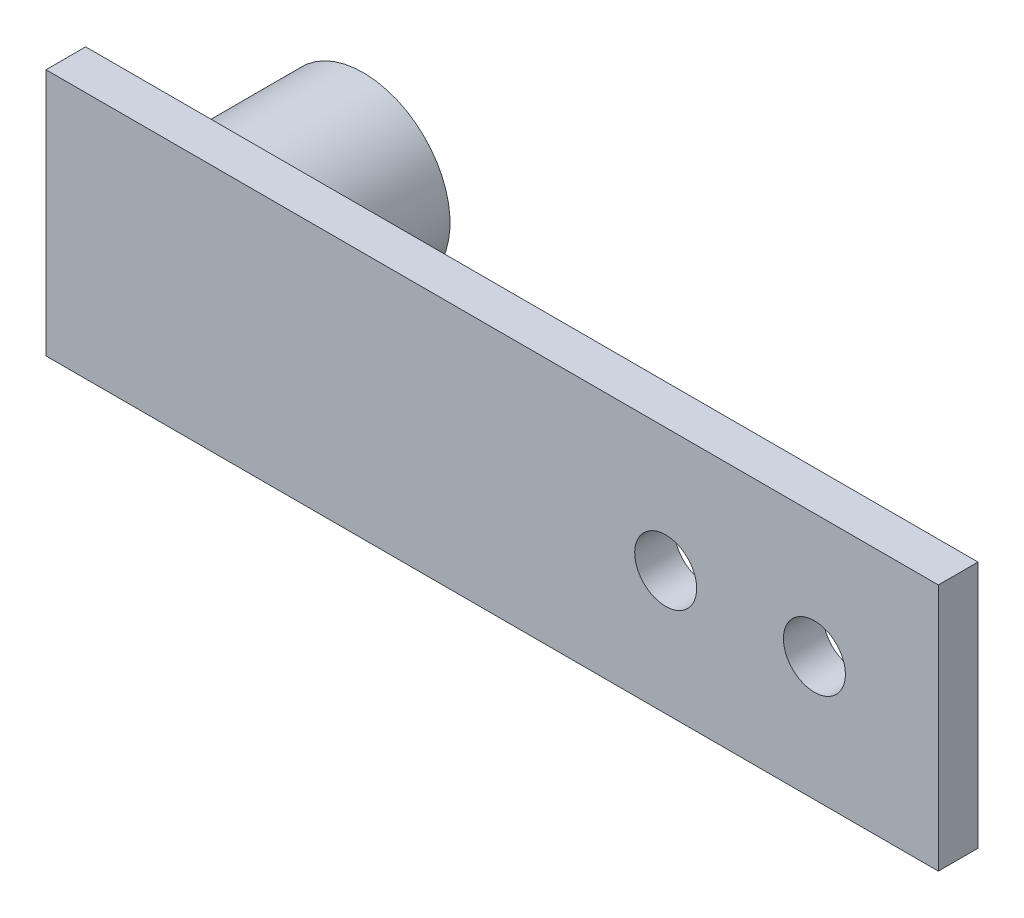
ISO-10303-21;
HEADER;
FILE_DESCRIPTION(('STEP AP214'),'2;1');
FILE_NAME('part.step','',(''),(''),'','','');
FILE_SCHEMA(('AUTOMOTIVE_DESIGN { 1 0 10303 214 1 1 1 1 }'));
ENDSEC;
DATA;
#1=APPLICATION_CONTEXT('core data for automotive mechanical design processes');
#2=APPLICATION_PROTOCOL_DEFINITION('international standard','automotive_design',2000,#1);
#3=PRODUCT_CONTEXT('',#1,'mechanical');
#4=PRODUCT('Part','Part','',(#3));
#5=PRODUCT_RELATED_PRODUCT_CATEGORY('part','',(#4));
#6=PRODUCT_DEFINITION_FORMATION('','',#4);
#7=PRODUCT_DEFINITION_CONTEXT('part definition',#1,'design');
#8=PRODUCT_DEFINITION('design','',#6,#7);
#9=PRODUCT_DEFINITION_SHAPE('','',#8);
#10=(LENGTH_UNIT() NAMED_UNIT(*) SI_UNIT(.MILLI.,.METRE.));
#11=(NAMED_UNIT(*) PLANE_ANGLE_UNIT() SI_UNIT($,.RADIAN.));
#12=(NAMED_UNIT(*) SI_UNIT($,.STERADIAN.) SOLID_ANGLE_UNIT());
#13=UNCERTAINTY_MEASURE_WITH_UNIT(LENGTH_MEASURE(1.E-05),#10,'distance_accuracy_value','');
#14=(GEOMETRIC_REPRESENTATION_CONTEXT(3) GLOBAL_UNCERTAINTY_ASSIGNED_CONTEXT((#13)) GLOBAL_UNIT_ASSIGNED_CONTEXT((#10,
#11,#12)) REPRESENTATION_CONTEXT('',''));
#15=CARTESIAN_POINT('',(0.,0.,0.));
#16=DIRECTION('',(0.,0.,1.));
#17=DIRECTION('',(1.,0.,0.));
#18=AXIS2_PLACEMENT_3D('',#15,#16,#17);
#19=CARTESIAN_POINT('',(-25.,25.,30.));
#20=DIRECTION('',(0.,0.,1.));
#21=DIRECTION('',(0.,-1.,0.));
#22=AXIS2_PLACEMENT_3D('',#19,#20,#21);
#23=PLANE('',#22);
#24=CARTESIAN_POINT('',(0.,0.,30.));
#25=DIRECTION('',(0.,0.,-1.));
#26=DIRECTION('',(-1.,0.,0.));
#27=AXIS2_PLACEMENT_3D('',#24,#25,#26);
#28=CIRCLE('',#27,17.5);
#29=CARTESIAN_POINT('',(-17.5,0.,30.));
#30=VERTEX_POINT('',#29);
#31=CARTESIAN_POINT('',(0.,17.5,30.));
#32=VERTEX_POINT('',#31);
#33=EDGE_CURVE('E25',#30,#32,#28,.T.);
#34=ORIENTED_EDGE('',*,*,#33,.F.);
#35=DIRECTION('',(0.,-1.,0.));
#36=VECTOR('',#35,1.);
#37=CARTESIAN_POINT('',(-17.5,17.5,30.));
#38=LINE('',#37,#36);
#39=CARTESIAN_POINT('',(-17.5,17.5,30.));
#40=VERTEX_POINT('',#39);
#41=EDGE_CURVE('E96',#40,#30,#38,.T.);
#42=ORIENTED_EDGE('',*,*,#41,.F.);
#43=DIRECTION('',(-1.,0.,0.));
#44=VECTOR('',#43,1.);
#45=CARTESIAN_POINT('',(17.5,17.5,30.));
#46=LINE('',#45,#44);
#47=EDGE_CURVE('E111',#32,#40,#46,.T.);
#48=ORIENTED_EDGE('',*,*,#47,.F.);
#49=EDGE_LOOP('',(#34,#42,#48));
#50=FACE_BOUND('',#49,.T.);
#51=ADVANCED_FACE('F14',(#50),#23,.F.);
#52=CARTESIAN_POINT('',(17.5,0.,30.));
#53=VERTEX_POINT('',#52);
#54=EDGE_CURVE('E9',#32,#53,#28,.T.);
#55=ORIENTED_EDGE('',*,*,#54,.F.);
#56=CARTESIAN_POINT('',(17.5,17.5,30.));
#57=VERTEX_POINT('',#56);
#58=EDGE_CURVE('E109',#57,#32,#46,.T.);
#59=ORIENTED_EDGE('',*,*,#58,.F.);
#60=DIRECTION('',(0.,1.,0.));
#61=VECTOR('',#60,1.);
#62=CARTESIAN_POINT('',(17.5,17.5,30.));
#63=LINE('',#62,#61);
#64=EDGE_CURVE('E175',#53,#57,#63,.T.);
#65=ORIENTED_EDGE('',*,*,#64,.F.);
#66=EDGE_LOOP('',(#55,#59,#65));
#67=FACE_BOUND('',#66,.T.);
#68=ADVANCED_FACE('F193',(#67),#23,.F.);
#69=CARTESIAN_POINT('',(0.,-17.5,30.));
#70=VERTEX_POINT('',#69);
#71=EDGE_CURVE('E23',#53,#70,#28,.T.);
#72=ORIENTED_EDGE('',*,*,#71,.F.);
#73=CARTESIAN_POINT('',(17.5,-17.5,30.));
#74=VERTEX_POINT('',#73);
#75=EDGE_CURVE('E163',#74,#53,#63,.T.);
#76=ORIENTED_EDGE('',*,*,#75,.F.);
#77=DIRECTION('',(1.,0.,0.));
#78=VECTOR('',#77,1.);
#79=CARTESIAN_POINT('',(17.5,-17.5,30.));
#80=LINE('',#79,#78);
#81=EDGE_CURVE('E103',#70,#74,#80,.T.);
#82=ORIENTED_EDGE('',*,*,#81,.F.);
#83=EDGE_LOOP('',(#72,#76,#82));
#84=FACE_BOUND('',#83,.T.);
#85=ADVANCED_FACE('F196',(#84),#23,.F.);
#86=EDGE_CURVE('E38',#70,#30,#28,.T.);
#87=ORIENTED_EDGE('',*,*,#86,.F.);
#88=CARTESIAN_POINT('',(-17.5,-17.5,30.));
#89=VERTEX_POINT('',#88);
#90=EDGE_CURVE('E107',#89,#70,#80,.T.);
#91=ORIENTED_EDGE('',*,*,#90,.F.);
#92=EDGE_CURVE('E98',#30,#89,#38,.T.);
#93=ORIENTED_EDGE('',*,*,#92,.F.);
#94=EDGE_LOOP('',(#87,#91,#93));
#95=FACE_BOUND('',#94,.T.);
#96=ADVANCED_FACE('F105',(#95),#23,.F.);
#97=CARTESIAN_POINT('',(17.5,17.5,31.));
#98=DIRECTION('',(0.,-1.,0.));
#99=DIRECTION('',(1.,0.,0.));
#100=AXIS2_PLACEMENT_3D('',#97,#98,#99);
#101=PLANE('',#100);
#102=ORIENTED_EDGE('',*,*,#58,.T.);
#103=ORIENTED_EDGE('',*,*,#47,.T.);
#104=DIRECTION('',(0.,0.,-1.));
#105=VECTOR('',#104,1.);
#106=CARTESIAN_POINT('',(-17.5,17.5,31.));
#107=LINE('',#106,#105);
#108=CARTESIAN_POINT('',(-17.5,17.5,31.));
#109=VERTEX_POINT('',#108);
#110=EDGE_CURVE('E100',#109,#40,#107,.T.);
#111=ORIENTED_EDGE('',*,*,#110,.F.);
#112=DIRECTION('',(-1.,0.,0.));
#113=VECTOR('',#112,1.);
#114=CARTESIAN_POINT('',(17.5,17.5,31.));
#115=LINE('',#114,#113);
#116=CARTESIAN_POINT('',(17.5,17.5,31.));
#117=VERTEX_POINT('',#116);
#118=EDGE_CURVE('E159',#117,#109,#115,.T.);
#119=ORIENTED_EDGE('',*,*,#118,.F.);
#120=DIRECTION('',(0.,0.,-1.));
#121=VECTOR('',#120,1.);
#122=CARTESIAN_POINT('',(17.5,17.5,31.));
#123=LINE('',#122,#121);
#124=EDGE_CURVE('E172',#117,#57,#123,.T.);
#125=ORIENTED_EDGE('',*,*,#124,.T.);
#126=EDGE_LOOP('',(#102,#103,#111,#119,#125));
#127=FACE_BOUND('',#126,.T.);
#128=ADVANCED_FACE('F16',(#127),#101,.F.);
#129=CARTESIAN_POINT('',(-17.5,17.5,31.));
#130=DIRECTION('',(1.,0.,0.));
#131=DIRECTION('',(0.,0.,1.));
#132=AXIS2_PLACEMENT_3D('',#129,#130,#131);
#133=PLANE('',#132);
#134=ORIENTED_EDGE('',*,*,#41,.T.);
#135=ORIENTED_EDGE('',*,*,#92,.T.);
#136=DIRECTION('',(0.,0.,-1.));
#137=VECTOR('',#136,1.);
#138=CARTESIAN_POINT('',(-17.5,-17.5,31.));
#139=LINE('',#138,#137);
#140=CARTESIAN_POINT('',(-17.5,-17.5,31.));
#141=VERTEX_POINT('',#140);
#142=EDGE_CURVE('E117',#141,#89,#139,.T.);
#143=ORIENTED_EDGE('',*,*,#142,.F.);
#144=DIRECTION('',(0.,-1.,0.));
#145=VECTOR('',#144,1.);
#146=CARTESIAN_POINT('',(-17.5,17.5,31.));
#147=LINE('',#146,#145);
#148=EDGE_CURVE('E162',#109,#141,#147,.T.);
#149=ORIENTED_EDGE('',*,*,#148,.F.);
#150=ORIENTED_EDGE('',*,*,#110,.T.);
#151=EDGE_LOOP('',(#134,#135,#143,#149,#150));
#152=FACE_BOUND('',#151,.T.);
#153=ADVANCED_FACE('F97',(#152),#133,.F.);
#154=CARTESIAN_POINT('',(17.5,-17.5,31.));
#155=DIRECTION('',(0.,1.,0.));
#156=DIRECTION('',(0.,0.,1.));
#157=AXIS2_PLACEMENT_3D('',#154,#155,#156);
#158=PLANE('',#157);
#159=ORIENTED_EDGE('',*,*,#90,.T.);
#160=ORIENTED_EDGE('',*,*,#81,.T.);
#161=DIRECTION('',(0.,0.,-1.));
#162=VECTOR('',#161,1.);
#163=CARTESIAN_POINT('',(17.5,-17.5,31.));
#164=LINE('',#163,#162);
#165=CARTESIAN_POINT('',(17.5,-17.5,31.));
#166=VERTEX_POINT('',#165);
#167=EDGE_CURVE('E180',#166,#74,#164,.T.);
#168=ORIENTED_EDGE('',*,*,#167,.F.);
#169=DIRECTION('',(1.,0.,0.));
#170=VECTOR('',#169,1.);
#171=CARTESIAN_POINT('',(17.5,-17.5,31.));
#172=LINE('',#171,#170);
#173=EDGE_CURVE('E166',#141,#166,#172,.T.);
#174=ORIENTED_EDGE('',*,*,#173,.F.);
#175=ORIENTED_EDGE('',*,*,#142,.T.);
#176=EDGE_LOOP('',(#159,#160,#168,#174,#175));
#177=FACE_BOUND('',#176,.T.);
#178=ADVANCED_FACE('F185',(#177),#158,.F.);
#179=CARTESIAN_POINT('',(17.5,17.5,31.));
#180=DIRECTION('',(-1.,0.,0.));
#181=DIRECTION('',(0.,0.,-1.));
#182=AXIS2_PLACEMENT_3D('',#179,#180,#181);
#183=PLANE('',#182);
#184=ORIENTED_EDGE('',*,*,#75,.T.);
#185=ORIENTED_EDGE('',*,*,#64,.T.);
#186=ORIENTED_EDGE('',*,*,#124,.F.);
#187=DIRECTION('',(0.,1.,0.));
#188=VECTOR('',#187,1.);
#189=CARTESIAN_POINT('',(17.5,17.5,31.));
#190=LINE('',#189,#188);
#191=EDGE_CURVE('E169',#166,#117,#190,.T.);
#192=ORIENTED_EDGE('',*,*,#191,.F.);
#193=ORIENTED_EDGE('',*,*,#167,.T.);
#194=EDGE_LOOP('',(#184,#185,#186,#192,#193));
#195=FACE_BOUND('',#194,.T.);
#196=ADVANCED_FACE('F192',(#195),#183,.F.);
#197=CARTESIAN_POINT('',(-25.,25.,31.));
#198=DIRECTION('',(0.,0.,1.));
#199=DIRECTION('',(0.,-1.,0.));
#200=AXIS2_PLACEMENT_3D('',#197,#198,#199);
#201=PLANE('',#200);
#202=CARTESIAN_POINT('',(100.,0.,31.));
#203=DIRECTION('',(0.,0.,1.));
#204=DIRECTION('',(0.,-1.,0.));
#205=AXIS2_PLACEMENT_3D('',#202,#203,#204);
#206=CIRCLE('',#205,6.25);
#207=CARTESIAN_POINT('',(100.,-6.25,31.));
#208=VERTEX_POINT('',#207);
#209=EDGE_CURVE('E123',#208,#208,#206,.T.);
#210=ORIENTED_EDGE('',*,*,#209,.T.);
#211=EDGE_LOOP('',(#210));
#212=FACE_BOUND('',#211,.T.);
#213=CARTESIAN_POINT('',(130.,0.,31.));
#214=DIRECTION('',(0.,0.,1.));
#215=DIRECTION('',(0.,-1.,0.));
#216=AXIS2_PLACEMENT_3D('',#213,#214,#215);
#217=CIRCLE('',#216,6.25);
#218=CARTESIAN_POINT('',(130.,-6.25,31.));
#219=VERTEX_POINT('',#218);
#220=EDGE_CURVE('E18',#219,#219,#217,.T.);
#221=ORIENTED_EDGE('',*,*,#220,.T.);
#222=EDGE_LOOP('',(#221));
#223=FACE_BOUND('',#222,.T.);
#224=DIRECTION('',(-1.,0.,0.));
#225=VECTOR('',#224,1.);
#226=CARTESIAN_POINT('',(155.,25.,31.));
#227=LINE('',#226,#225);
#228=CARTESIAN_POINT('',(155.,25.,31.));
#229=VERTEX_POINT('',#228);
#230=CARTESIAN_POINT('',(-25.,25.,31.));
#231=VERTEX_POINT('',#230);
#232=EDGE_CURVE('E140',#229,#231,#227,.T.);
#233=ORIENTED_EDGE('',*,*,#232,.F.);
#234=DIRECTION('',(0.,1.,0.));
#235=VECTOR('',#234,1.);
#236=CARTESIAN_POINT('',(155.,25.,31.));
#237=LINE('',#236,#235);
#238=CARTESIAN_POINT('',(155.,-25.,31.));
#239=VERTEX_POINT('',#238);
#240=EDGE_CURVE('E133',#239,#229,#237,.T.);
#241=ORIENTED_EDGE('',*,*,#240,.F.);
#242=DIRECTION('',(1.,0.,0.));
#243=VECTOR('',#242,1.);
#244=CARTESIAN_POINT('',(155.,-25.,31.));
#245=LINE('',#244,#243);
#246=CARTESIAN_POINT('',(-25.,-25.,31.));
#247=VERTEX_POINT('',#246);
#248=EDGE_CURVE('E145',#247,#239,#245,.T.);
#249=ORIENTED_EDGE('',*,*,#248,.F.);
#250=DIRECTION('',(0.,-1.,0.));
#251=VECTOR('',#250,1.);
#252=CARTESIAN_POINT('',(-25.,25.,31.));
#253=LINE('',#252,#251);
#254=EDGE_CURVE('E143',#231,#247,#253,.T.);
#255=ORIENTED_EDGE('',*,*,#254,.F.);
#256=EDGE_LOOP('',(#233,#241,#249,#255));
#257=FACE_BOUND('',#256,.T.);
#258=ORIENTED_EDGE('',*,*,#191,.T.);
#259=ORIENTED_EDGE('',*,*,#118,.T.);
#260=ORIENTED_EDGE('',*,*,#148,.T.);
#261=ORIENTED_EDGE('',*,*,#173,.T.);
#262=EDGE_LOOP('',(#258,#259,#260,#261));
#263=FACE_BOUND('',#262,.T.);
#264=ADVANCED_FACE('F189',(#212,#223,#257,#263),#201,.F.);
#265=CARTESIAN_POINT('',(155.,25.,39.));
#266=DIRECTION('',(0.,-1.,0.));
#267=DIRECTION('',(1.,0.,0.));
#268=AXIS2_PLACEMENT_3D('',#265,#266,#267);
#269=PLANE('',#268);
#270=ORIENTED_EDGE('',*,*,#232,.T.);
#271=DIRECTION('',(0.,0.,-1.));
#272=VECTOR('',#271,1.);
#273=CARTESIAN_POINT('',(-25.,25.,39.));
#274=LINE('',#273,#272);
#275=CARTESIAN_POINT('',(-25.,25.,39.));
#276=VERTEX_POINT('',#275);
#277=EDGE_CURVE('E156',#276,#231,#274,.T.);
#278=ORIENTED_EDGE('',*,*,#277,.F.);
#279=DIRECTION('',(-1.,0.,0.));
#280=VECTOR('',#279,1.);
#281=CARTESIAN_POINT('',(155.,25.,39.));
#282=LINE('',#281,#280);
#283=CARTESIAN_POINT('',(155.,25.,39.));
#284=VERTEX_POINT('',#283);
#285=EDGE_CURVE('E129',#284,#276,#282,.T.);
#286=ORIENTED_EDGE('',*,*,#285,.F.);
#287=DIRECTION('',(0.,0.,-1.));
#288=VECTOR('',#287,1.);
#289=CARTESIAN_POINT('',(155.,25.,39.));
#290=LINE('',#289,#288);
#291=EDGE_CURVE('E139',#284,#229,#290,.T.);
#292=ORIENTED_EDGE('',*,*,#291,.T.);
#293=EDGE_LOOP('',(#270,#278,#286,#292));
#294=FACE_BOUND('',#293,.T.);
#295=ADVANCED_FACE('F266',(#294),#269,.F.);
#296=CARTESIAN_POINT('',(-25.,25.,39.));
#297=DIRECTION('',(1.,0.,0.));
#298=DIRECTION('',(0.,1.,0.));
#299=AXIS2_PLACEMENT_3D('',#296,#297,#298);
#300=PLANE('',#299);
#301=ORIENTED_EDGE('',*,*,#254,.T.);
#302=DIRECTION('',(0.,0.,-1.));
#303=VECTOR('',#302,1.);
#304=CARTESIAN_POINT('',(-25.,-25.,39.));
#305=LINE('',#304,#303);
#306=CARTESIAN_POINT('',(-25.,-25.,39.));
#307=VERTEX_POINT('',#306);
#308=EDGE_CURVE('E153',#307,#247,#305,.T.);
#309=ORIENTED_EDGE('',*,*,#308,.F.);
#310=DIRECTION('',(0.,-1.,0.));
#311=VECTOR('',#310,1.);
#312=CARTESIAN_POINT('',(-25.,25.,39.));
#313=LINE('',#312,#311);
#314=EDGE_CURVE('E132',#276,#307,#313,.T.);
#315=ORIENTED_EDGE('',*,*,#314,.F.);
#316=ORIENTED_EDGE('',*,*,#277,.T.);
#317=EDGE_LOOP('',(#301,#309,#315,#316));
#318=FACE_BOUND('',#317,.T.);
#319=ADVANCED_FACE('F275',(#318),#300,.F.);
#320=CARTESIAN_POINT('',(155.,-25.,39.));
#321=DIRECTION('',(0.,1.,0.));
#322=DIRECTION('',(-1.,0.,0.));
#323=AXIS2_PLACEMENT_3D('',#320,#321,#322);
#324=PLANE('',#323);
#325=ORIENTED_EDGE('',*,*,#248,.T.);
#326=DIRECTION('',(0.,0.,-1.));
#327=VECTOR('',#326,1.);
#328=CARTESIAN_POINT('',(155.,-25.,39.));
#329=LINE('',#328,#327);
#330=CARTESIAN_POINT('',(155.,-25.,39.));
#331=VERTEX_POINT('',#330);
#332=EDGE_CURVE('E150',#331,#239,#329,.T.);
#333=ORIENTED_EDGE('',*,*,#332,.F.);
#334=DIRECTION('',(1.,0.,0.));
#335=VECTOR('',#334,1.);
#336=CARTESIAN_POINT('',(155.,-25.,39.));
#337=LINE('',#336,#335);
#338=EDGE_CURVE('E135',#307,#331,#337,.T.);
#339=ORIENTED_EDGE('',*,*,#338,.F.);
#340=ORIENTED_EDGE('',*,*,#308,.T.);
#341=EDGE_LOOP('',(#325,#333,#339,#340));
#342=FACE_BOUND('',#341,.T.);
#343=ADVANCED_FACE('F284',(#342),#324,.F.);
#344=CARTESIAN_POINT('',(155.,25.,39.));
#345=DIRECTION('',(-1.,0.,0.));
#346=DIRECTION('',(0.,0.,-1.));
#347=AXIS2_PLACEMENT_3D('',#344,#345,#346);
#348=PLANE('',#347);
#349=ORIENTED_EDGE('',*,*,#240,.T.);
#350=ORIENTED_EDGE('',*,*,#291,.F.);
#351=DIRECTION('',(0.,1.,0.));
#352=VECTOR('',#351,1.);
#353=CARTESIAN_POINT('',(155.,25.,39.));
#354=LINE('',#353,#352);
#355=EDGE_CURVE('E137',#331,#284,#354,.T.);
#356=ORIENTED_EDGE('',*,*,#355,.F.);
#357=ORIENTED_EDGE('',*,*,#332,.T.);
#358=EDGE_LOOP('',(#349,#350,#356,#357));
#359=FACE_BOUND('',#358,.T.);
#360=ADVANCED_FACE('F293',(#359),#348,.F.);
#361=CARTESIAN_POINT('',(-25.,25.,39.));
#362=DIRECTION('',(0.,0.,1.));
#363=DIRECTION('',(0.,-1.,0.));
#364=AXIS2_PLACEMENT_3D('',#361,#362,#363);
#365=PLANE('',#364);
#366=CARTESIAN_POINT('',(100.,0.,39.));
#367=DIRECTION('',(0.,0.,1.));
#368=DIRECTION('',(0.,-1.,0.));
#369=AXIS2_PLACEMENT_3D('',#366,#367,#368);
#370=CIRCLE('',#369,6.25);
#371=CARTESIAN_POINT('',(100.,-6.25,39.));
#372=VERTEX_POINT('',#371);
#373=EDGE_CURVE('E120',#372,#372,#370,.T.);
#374=ORIENTED_EDGE('',*,*,#373,.F.);
#375=EDGE_LOOP('',(#374));
#376=FACE_BOUND('',#375,.T.);
#377=CARTESIAN_POINT('',(130.,0.,39.));
#378=DIRECTION('',(0.,0.,1.));
#379=DIRECTION('',(0.,-1.,0.));
#380=AXIS2_PLACEMENT_3D('',#377,#378,#379);
#381=CIRCLE('',#380,6.25);
#382=CARTESIAN_POINT('',(130.,-6.25,39.));
#383=VERTEX_POINT('',#382);
#384=EDGE_CURVE('E126',#383,#383,#381,.T.);
#385=ORIENTED_EDGE('',*,*,#384,.F.);
#386=EDGE_LOOP('',(#385));
#387=FACE_BOUND('',#386,.T.);
#388=ORIENTED_EDGE('',*,*,#285,.T.);
#389=ORIENTED_EDGE('',*,*,#314,.T.);
#390=ORIENTED_EDGE('',*,*,#338,.T.);
#391=ORIENTED_EDGE('',*,*,#355,.T.);
#392=EDGE_LOOP('',(#388,#389,#390,#391));
#393=FACE_BOUND('',#392,.T.);
#394=ADVANCED_FACE('F302',(#376,#387,#393),#365,.T.);
#395=CARTESIAN_POINT('',(130.,0.,39.));
#396=DIRECTION('',(0.,0.,1.));
#397=DIRECTION('',(0.,-1.,0.));
#398=AXIS2_PLACEMENT_3D('',#395,#396,#397);
#399=CYLINDRICAL_SURFACE('',#398,6.25);
#400=ORIENTED_EDGE('',*,*,#384,.T.);
#401=EDGE_LOOP('',(#400));
#402=FACE_BOUND('',#401,.T.);
#403=ORIENTED_EDGE('',*,*,#220,.F.);
#404=EDGE_LOOP('',(#403));
#405=FACE_BOUND('',#404,.T.);
#406=ADVANCED_FACE('F311',(#402,#405),#399,.F.);
#407=CARTESIAN_POINT('',(100.,0.,39.));
#408=DIRECTION('',(0.,0.,1.));
#409=DIRECTION('',(0.,-1.,0.));
#410=AXIS2_PLACEMENT_3D('',#407,#408,#409);
#411=CYLINDRICAL_SURFACE('',#410,6.25);
#412=ORIENTED_EDGE('',*,*,#373,.T.);
#413=EDGE_LOOP('',(#412));
#414=FACE_BOUND('',#413,.T.);
#415=ORIENTED_EDGE('',*,*,#209,.F.);
#416=EDGE_LOOP('',(#415));
#417=FACE_BOUND('',#416,.T.);
#418=ADVANCED_FACE('F320',(#414,#417),#411,.F.);
#419=CARTESIAN_POINT('',(0.,0.,0.));
#420=DIRECTION('',(0.,0.,1.));
#421=DIRECTION('',(1.,0.,0.));
#422=AXIS2_PLACEMENT_3D('',#419,#420,#421);
#423=CYLINDRICAL_SURFACE('',#422,17.5);
#424=CARTESIAN_POINT('',(0.,0.,0.));
#425=DIRECTION('',(0.,0.,-1.));
#426=DIRECTION('',(-1.,0.,0.));
#427=AXIS2_PLACEMENT_3D('',#424,#425,#426);
#428=CIRCLE('',#427,17.5);
#429=CARTESIAN_POINT('',(-17.5,0.,0.));
#430=VERTEX_POINT('',#429);
#431=EDGE_CURVE('E114',#430,#430,#428,.T.);
#432=ORIENTED_EDGE('',*,*,#431,.F.);
#433=EDGE_LOOP('',(#432));
#434=FACE_BOUND('',#433,.T.);
#435=ORIENTED_EDGE('',*,*,#33,.T.);
#436=ORIENTED_EDGE('',*,*,#54,.T.);
#437=ORIENTED_EDGE('',*,*,#71,.T.);
#438=ORIENTED_EDGE('',*,*,#86,.T.);
#439=EDGE_LOOP('',(#435,#436,#437,#438));
#440=FACE_BOUND('',#439,.T.);
#441=ADVANCED_FACE('F116',(#434,#440),#423,.T.);
#442=CARTESIAN_POINT('',(0.,0.,0.));
#443=DIRECTION('',(0.,0.,-1.));
#444=DIRECTION('',(-1.,0.,0.));
#445=AXIS2_PLACEMENT_3D('',#442,#443,#444);
#446=PLANE('',#445);
#447=ORIENTED_EDGE('',*,*,#431,.T.);
#448=EDGE_LOOP('',(#447));
#449=FACE_BOUND('',#448,.T.);
#450=ADVANCED_FACE('F336',(#449),#446,.T.);
#451=CLOSED_SHELL('',(#51,#68,#85,#96,#128,#153,#178,#196,#264,#295,#319,#343,#360,#394,#406,
#418,#441,#450));
#452=MANIFOLD_SOLID_BREP('B1',#451);
#453=ADVANCED_BREP_SHAPE_REPRESENTATION('',(#18,#452),#14);
#454=SHAPE_DEFINITION_REPRESENTATION(#9,#453);
ENDSEC;
END-ISO-10303-21;
